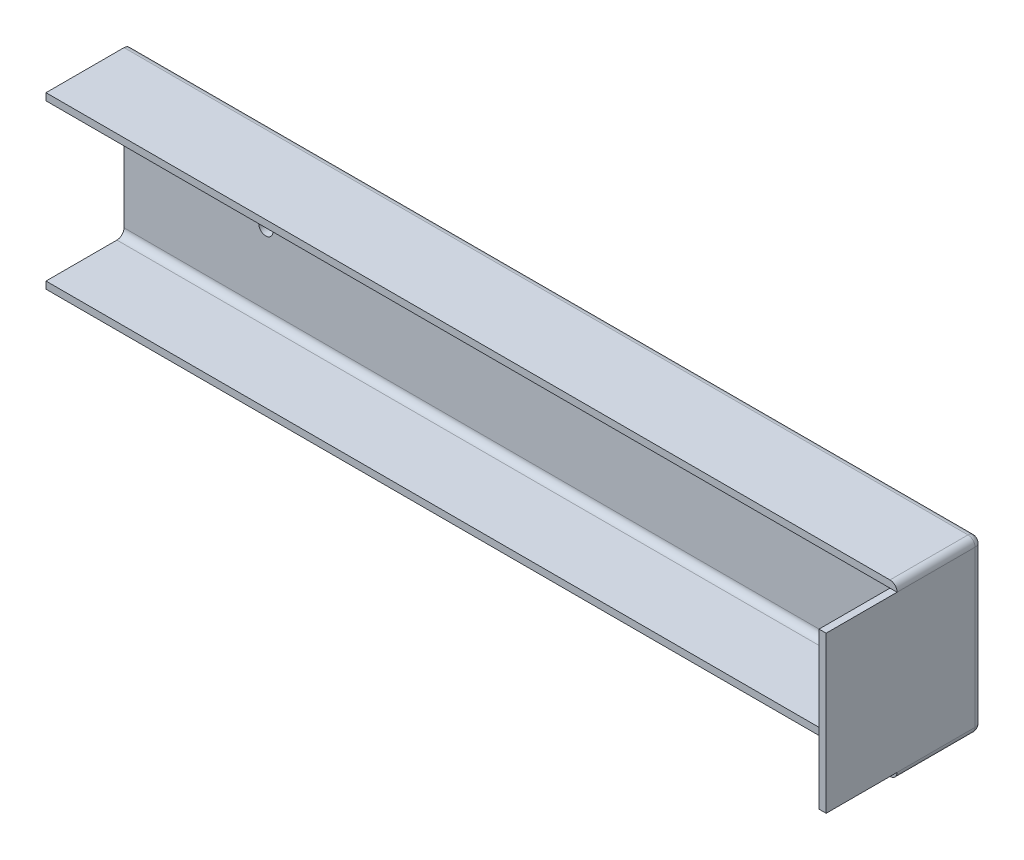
ISO-10303-21;
HEADER;
FILE_DESCRIPTION(('STEP AP214'),'2;1');
FILE_NAME('part.step','',(''),(''),'','','');
FILE_SCHEMA(('AUTOMOTIVE_DESIGN { 1 0 10303 214 1 1 1 1 }'));
ENDSEC;
DATA;
#1=APPLICATION_CONTEXT('core data for automotive mechanical design processes');
#2=APPLICATION_PROTOCOL_DEFINITION('international standard','automotive_design',2000,#1);
#3=PRODUCT_CONTEXT('',#1,'mechanical');
#4=PRODUCT('Part','Part','',(#3));
#5=PRODUCT_RELATED_PRODUCT_CATEGORY('part','',(#4));
#6=PRODUCT_DEFINITION_FORMATION('','',#4);
#7=PRODUCT_DEFINITION_CONTEXT('part definition',#1,'design');
#8=PRODUCT_DEFINITION('design','',#6,#7);
#9=PRODUCT_DEFINITION_SHAPE('','',#8);
#10=(LENGTH_UNIT() NAMED_UNIT(*) SI_UNIT(.MILLI.,.METRE.));
#11=(NAMED_UNIT(*) PLANE_ANGLE_UNIT() SI_UNIT($,.RADIAN.));
#12=(NAMED_UNIT(*) SI_UNIT($,.STERADIAN.) SOLID_ANGLE_UNIT());
#13=UNCERTAINTY_MEASURE_WITH_UNIT(LENGTH_MEASURE(1.E-05),#10,'distance_accuracy_value','');
#14=(GEOMETRIC_REPRESENTATION_CONTEXT(3) GLOBAL_UNCERTAINTY_ASSIGNED_CONTEXT((#13)) GLOBAL_UNIT_ASSIGNED_CONTEXT((#10,
#11,#12)) REPRESENTATION_CONTEXT('',''));
#15=CARTESIAN_POINT('',(0.,0.,0.));
#16=DIRECTION('',(0.,0.,1.));
#17=DIRECTION('',(1.,0.,0.));
#18=AXIS2_PLACEMENT_3D('',#15,#16,#17);
#19=CARTESIAN_POINT('',(-120.,-22.,2.));
#20=DIRECTION('',(0.,-1.,0.));
#21=DIRECTION('',(0.,0.,-1.));
#22=AXIS2_PLACEMENT_3D('',#19,#20,#21);
#23=PLANE('',#22);
#24=DIRECTION('',(0.,0.,-1.));
#25=VECTOR('',#24,1.);
#26=CARTESIAN_POINT('',(118.,-22.,44.));
#27=LINE('',#26,#25);
#28=CARTESIAN_POINT('',(118.,-22.,24.));
#29=VERTEX_POINT('',#28);
#30=CARTESIAN_POINT('',(118.,-22.,4.));
#31=VERTEX_POINT('',#30);
#32=EDGE_CURVE('E172',#29,#31,#27,.T.);
#33=ORIENTED_EDGE('',*,*,#32,.T.);
#34=DIRECTION('',(1.,0.,0.));
#35=VECTOR('',#34,1.);
#36=CARTESIAN_POINT('',(-120.,-22.,4.));
#37=LINE('',#36,#35);
#38=CARTESIAN_POINT('',(-120.,-22.,4.));
#39=VERTEX_POINT('',#38);
#40=EDGE_CURVE('E250',#31,#39,#37,.F.);
#41=ORIENTED_EDGE('',*,*,#40,.T.);
#42=DIRECTION('',(0.,0.,1.));
#43=VECTOR('',#42,1.);
#44=CARTESIAN_POINT('',(-120.,-22.,2.));
#45=LINE('',#44,#43);
#46=CARTESIAN_POINT('',(-120.,-22.,24.));
#47=VERTEX_POINT('',#46);
#48=EDGE_CURVE('E207',#39,#47,#45,.T.);
#49=ORIENTED_EDGE('',*,*,#48,.T.);
#50=DIRECTION('',(1.,0.,0.));
#51=VECTOR('',#50,1.);
#52=CARTESIAN_POINT('',(-120.,-22.,24.));
#53=LINE('',#52,#51);
#54=EDGE_CURVE('E202',#47,#29,#53,.T.);
#55=ORIENTED_EDGE('',*,*,#54,.T.);
#56=EDGE_LOOP('',(#33,#41,#49,#55));
#57=FACE_BOUND('',#56,.T.);
#58=ADVANCED_FACE('F35',(#57),#23,.F.);
#59=CARTESIAN_POINT('',(-120.,22.,2.));
#60=DIRECTION('',(0.,1.,0.));
#61=DIRECTION('',(0.,0.,1.));
#62=AXIS2_PLACEMENT_3D('',#59,#60,#61);
#63=PLANE('',#62);
#64=DIRECTION('',(0.,0.,1.));
#65=VECTOR('',#64,1.);
#66=CARTESIAN_POINT('',(118.,22.,44.));
#67=LINE('',#66,#65);
#68=CARTESIAN_POINT('',(118.,22.,4.));
#69=VERTEX_POINT('',#68);
#70=CARTESIAN_POINT('',(118.,22.,24.));
#71=VERTEX_POINT('',#70);
#72=EDGE_CURVE('E164',#69,#71,#67,.T.);
#73=ORIENTED_EDGE('',*,*,#72,.T.);
#74=DIRECTION('',(-1.,0.,0.));
#75=VECTOR('',#74,1.);
#76=CARTESIAN_POINT('',(-120.,22.,24.));
#77=LINE('',#76,#75);
#78=CARTESIAN_POINT('',(-120.,22.,24.));
#79=VERTEX_POINT('',#78);
#80=EDGE_CURVE('E197',#71,#79,#77,.T.);
#81=ORIENTED_EDGE('',*,*,#80,.T.);
#82=DIRECTION('',(0.,0.,1.));
#83=VECTOR('',#82,1.);
#84=CARTESIAN_POINT('',(-120.,22.,2.));
#85=LINE('',#84,#83);
#86=CARTESIAN_POINT('',(-120.,22.,4.));
#87=VERTEX_POINT('',#86);
#88=EDGE_CURVE('E201',#87,#79,#85,.T.);
#89=ORIENTED_EDGE('',*,*,#88,.F.);
#90=DIRECTION('',(-1.,0.,0.));
#91=VECTOR('',#90,1.);
#92=CARTESIAN_POINT('',(-120.,22.,4.));
#93=LINE('',#92,#91);
#94=EDGE_CURVE('E247',#87,#69,#93,.F.);
#95=ORIENTED_EDGE('',*,*,#94,.T.);
#96=EDGE_LOOP('',(#73,#81,#89,#95));
#97=FACE_BOUND('',#96,.T.);
#98=ADVANCED_FACE('F304',(#97),#63,.F.);
#99=CARTESIAN_POINT('',(0.,0.,2.));
#100=DIRECTION('',(0.,0.,1.));
#101=DIRECTION('',(1.,0.,0.));
#102=AXIS2_PLACEMENT_3D('',#99,#100,#101);
#103=PLANE('',#102);
#104=CARTESIAN_POINT('',(-80.,0.,2.));
#105=DIRECTION('',(0.,0.,1.));
#106=DIRECTION('',(1.,0.,0.));
#107=AXIS2_PLACEMENT_3D('',#104,#105,#106);
#108=CIRCLE('',#107,2.);
#109=CARTESIAN_POINT('',(-78.,0.,2.));
#110=VERTEX_POINT('',#109);
#111=EDGE_CURVE('E182',#110,#110,#108,.T.);
#112=ORIENTED_EDGE('',*,*,#111,.F.);
#113=EDGE_LOOP('',(#112));
#114=FACE_BOUND('',#113,.T.);
#115=DIRECTION('',(1.,0.,0.));
#116=VECTOR('',#115,1.);
#117=CARTESIAN_POINT('',(0.,-20.,2.));
#118=LINE('',#117,#116);
#119=CARTESIAN_POINT('',(-120.,-20.,2.));
#120=VERTEX_POINT('',#119);
#121=CARTESIAN_POINT('',(118.,-20.,2.));
#122=VERTEX_POINT('',#121);
#123=EDGE_CURVE('E242',#120,#122,#118,.T.);
#124=ORIENTED_EDGE('',*,*,#123,.T.);
#125=DIRECTION('',(0.,1.,0.));
#126=VECTOR('',#125,1.);
#127=CARTESIAN_POINT('',(118.,0.,2.));
#128=LINE('',#127,#126);
#129=CARTESIAN_POINT('',(118.,20.,2.));
#130=VERTEX_POINT('',#129);
#131=EDGE_CURVE('E189',#122,#130,#128,.T.);
#132=ORIENTED_EDGE('',*,*,#131,.T.);
#133=DIRECTION('',(-1.,0.,0.));
#134=VECTOR('',#133,1.);
#135=CARTESIAN_POINT('',(0.,20.,2.));
#136=LINE('',#135,#134);
#137=CARTESIAN_POINT('',(-120.,20.,2.));
#138=VERTEX_POINT('',#137);
#139=EDGE_CURVE('E245',#130,#138,#136,.T.);
#140=ORIENTED_EDGE('',*,*,#139,.T.);
#141=DIRECTION('',(0.,-1.,0.));
#142=VECTOR('',#141,1.);
#143=CARTESIAN_POINT('',(-120.,22.,2.));
#144=LINE('',#143,#142);
#145=EDGE_CURVE('E198',#138,#120,#144,.T.);
#146=ORIENTED_EDGE('',*,*,#145,.T.);
#147=EDGE_LOOP('',(#124,#132,#140,#146));
#148=FACE_BOUND('',#147,.T.);
#149=ADVANCED_FACE('F316',(#114,#148),#103,.T.);
#150=CARTESIAN_POINT('',(0.,20.,4.));
#151=DIRECTION('',(-1.,0.,0.));
#152=DIRECTION('',(0.,0.,1.));
#153=AXIS2_PLACEMENT_3D('',#150,#151,#152);
#154=CYLINDRICAL_SURFACE('',#153,2.);
#155=CARTESIAN_POINT('',(118.,20.,4.));
#156=DIRECTION('',(1.,0.,0.));
#157=DIRECTION('',(0.,0.,-1.));
#158=AXIS2_PLACEMENT_3D('',#155,#156,#157);
#159=CIRCLE('',#158,2.);
#160=EDGE_CURVE('E193',#69,#130,#159,.F.);
#161=ORIENTED_EDGE('',*,*,#160,.F.);
#162=ORIENTED_EDGE('',*,*,#94,.F.);
#163=CARTESIAN_POINT('',(-120.,20.,4.));
#164=DIRECTION('',(1.,0.,0.));
#165=DIRECTION('',(0.,0.,-1.));
#166=AXIS2_PLACEMENT_3D('',#163,#164,#165);
#167=CIRCLE('',#166,2.);
#168=EDGE_CURVE('E252',#138,#87,#167,.T.);
#169=ORIENTED_EDGE('',*,*,#168,.F.);
#170=ORIENTED_EDGE('',*,*,#139,.F.);
#171=EDGE_LOOP('',(#161,#162,#169,#170));
#172=FACE_BOUND('',#171,.T.);
#173=ADVANCED_FACE('F313',(#172),#154,.F.);
#174=CARTESIAN_POINT('',(0.,-20.,4.));
#175=DIRECTION('',(1.,0.,0.));
#176=DIRECTION('',(0.,0.,-1.));
#177=AXIS2_PLACEMENT_3D('',#174,#175,#176);
#178=CYLINDRICAL_SURFACE('',#177,2.);
#179=CARTESIAN_POINT('',(118.,-20.,4.));
#180=DIRECTION('',(1.,0.,0.));
#181=DIRECTION('',(0.,0.,-1.));
#182=AXIS2_PLACEMENT_3D('',#179,#180,#181);
#183=CIRCLE('',#182,2.);
#184=EDGE_CURVE('E256',#122,#31,#183,.F.);
#185=ORIENTED_EDGE('',*,*,#184,.F.);
#186=ORIENTED_EDGE('',*,*,#123,.F.);
#187=CARTESIAN_POINT('',(-120.,-20.,4.));
#188=DIRECTION('',(1.,0.,0.));
#189=DIRECTION('',(0.,0.,-1.));
#190=AXIS2_PLACEMENT_3D('',#187,#188,#189);
#191=CIRCLE('',#190,2.);
#192=EDGE_CURVE('E254',#39,#120,#191,.T.);
#193=ORIENTED_EDGE('',*,*,#192,.F.);
#194=ORIENTED_EDGE('',*,*,#40,.F.);
#195=EDGE_LOOP('',(#185,#186,#193,#194));
#196=FACE_BOUND('',#195,.T.);
#197=ADVANCED_FACE('F320',(#196),#178,.F.);
#198=CARTESIAN_POINT('',(0.,0.,24.));
#199=DIRECTION('',(0.,0.,1.));
#200=DIRECTION('',(1.,0.,0.));
#201=AXIS2_PLACEMENT_3D('',#198,#199,#200);
#202=PLANE('',#201);
#203=DIRECTION('',(1.,0.,0.));
#204=VECTOR('',#203,1.);
#205=CARTESIAN_POINT('',(-120.,-24.,24.));
#206=LINE('',#205,#204);
#207=CARTESIAN_POINT('',(-120.,-24.,24.));
#208=VERTEX_POINT('',#207);
#209=CARTESIAN_POINT('',(118.,-24.,24.));
#210=VERTEX_POINT('',#209);
#211=EDGE_CURVE('E218',#208,#210,#206,.T.);
#212=ORIENTED_EDGE('',*,*,#211,.T.);
#213=CARTESIAN_POINT('',(118.,-22.,24.));
#214=DIRECTION('',(0.,0.,1.));
#215=DIRECTION('',(1.,0.,0.));
#216=AXIS2_PLACEMENT_3D('',#213,#214,#215);
#217=CIRCLE('',#216,2.);
#218=CARTESIAN_POINT('',(120.,-22.,24.));
#219=VERTEX_POINT('',#218);
#220=EDGE_CURVE('E267',#210,#219,#217,.T.);
#221=ORIENTED_EDGE('',*,*,#220,.T.);
#222=DIRECTION('',(1.,0.,0.));
#223=VECTOR('',#222,1.);
#224=CARTESIAN_POINT('',(0.,-22.,24.));
#225=LINE('',#224,#223);
#226=EDGE_CURVE('E195',#29,#219,#225,.T.);
#227=ORIENTED_EDGE('',*,*,#226,.F.);
#228=ORIENTED_EDGE('',*,*,#54,.F.);
#229=DIRECTION('',(0.,-1.,0.));
#230=VECTOR('',#229,1.);
#231=CARTESIAN_POINT('',(-120.,24.,24.));
#232=LINE('',#231,#230);
#233=EDGE_CURVE('E214',#47,#208,#232,.T.);
#234=ORIENTED_EDGE('',*,*,#233,.T.);
#235=EDGE_LOOP('',(#212,#221,#227,#228,#234));
#236=FACE_BOUND('',#235,.T.);
#237=ADVANCED_FACE('F327',(#236),#202,.T.);
#238=CARTESIAN_POINT('',(120.,24.,24.));
#239=DIRECTION('',(-1.,0.,0.));
#240=DIRECTION('',(0.,0.,1.));
#241=AXIS2_PLACEMENT_3D('',#238,#239,#240);
#242=PLANE('',#241);
#243=DIRECTION('',(0.,0.,-1.));
#244=VECTOR('',#243,1.);
#245=CARTESIAN_POINT('',(120.,-22.,44.));
#246=LINE('',#245,#244);
#247=CARTESIAN_POINT('',(120.,-22.,44.));
#248=VERTEX_POINT('',#247);
#249=EDGE_CURVE('E158',#248,#219,#246,.T.);
#250=ORIENTED_EDGE('',*,*,#249,.T.);
#251=DIRECTION('',(0.,0.,-1.));
#252=VECTOR('',#251,1.);
#253=CARTESIAN_POINT('',(120.,-22.,24.));
#254=LINE('',#253,#252);
#255=CARTESIAN_POINT('',(120.,-22.,2.));
#256=VERTEX_POINT('',#255);
#257=EDGE_CURVE('E262',#219,#256,#254,.T.);
#258=ORIENTED_EDGE('',*,*,#257,.T.);
#259=DIRECTION('',(0.,1.,0.));
#260=VECTOR('',#259,1.);
#261=CARTESIAN_POINT('',(120.,24.,2.));
#262=LINE('',#261,#260);
#263=CARTESIAN_POINT('',(120.,22.,2.));
#264=VERTEX_POINT('',#263);
#265=EDGE_CURVE('E258',#256,#264,#262,.T.);
#266=ORIENTED_EDGE('',*,*,#265,.T.);
#267=DIRECTION('',(0.,0.,-1.));
#268=VECTOR('',#267,1.);
#269=CARTESIAN_POINT('',(120.,22.,24.));
#270=LINE('',#269,#268);
#271=CARTESIAN_POINT('',(120.,22.,24.));
#272=VERTEX_POINT('',#271);
#273=EDGE_CURVE('E260',#264,#272,#270,.F.);
#274=ORIENTED_EDGE('',*,*,#273,.T.);
#275=DIRECTION('',(0.,0.,1.));
#276=VECTOR('',#275,1.);
#277=CARTESIAN_POINT('',(120.,22.,44.));
#278=LINE('',#277,#276);
#279=CARTESIAN_POINT('',(120.,22.,44.));
#280=VERTEX_POINT('',#279);
#281=EDGE_CURVE('E178',#272,#280,#278,.T.);
#282=ORIENTED_EDGE('',*,*,#281,.T.);
#283=DIRECTION('',(0.,-1.,0.));
#284=VECTOR('',#283,1.);
#285=CARTESIAN_POINT('',(120.,22.,44.));
#286=LINE('',#285,#284);
#287=EDGE_CURVE('E186',#280,#248,#286,.T.);
#288=ORIENTED_EDGE('',*,*,#287,.T.);
#289=EDGE_LOOP('',(#250,#258,#266,#274,#282,#288));
#290=FACE_BOUND('',#289,.T.);
#291=ADVANCED_FACE('F295',(#290),#242,.F.);
#292=CARTESIAN_POINT('',(-120.,24.,24.));
#293=DIRECTION('',(0.,-1.,0.));
#294=DIRECTION('',(0.,0.,-1.));
#295=AXIS2_PLACEMENT_3D('',#292,#293,#294);
#296=PLANE('',#295);
#297=DIRECTION('',(-1.,0.,0.));
#298=VECTOR('',#297,1.);
#299=CARTESIAN_POINT('',(-120.,24.,24.));
#300=LINE('',#299,#298);
#301=CARTESIAN_POINT('',(118.,24.,24.));
#302=VERTEX_POINT('',#301);
#303=CARTESIAN_POINT('',(-120.,24.,24.));
#304=VERTEX_POINT('',#303);
#305=EDGE_CURVE('E212',#302,#304,#300,.T.);
#306=ORIENTED_EDGE('',*,*,#305,.F.);
#307=DIRECTION('',(0.,0.,-1.));
#308=VECTOR('',#307,1.);
#309=CARTESIAN_POINT('',(118.,24.,24.));
#310=LINE('',#309,#308);
#311=CARTESIAN_POINT('',(118.,24.,2.));
#312=VERTEX_POINT('',#311);
#313=EDGE_CURVE('E271',#302,#312,#310,.T.);
#314=ORIENTED_EDGE('',*,*,#313,.T.);
#315=DIRECTION('',(-1.,0.,0.));
#316=VECTOR('',#315,1.);
#317=CARTESIAN_POINT('',(-120.,24.,2.));
#318=LINE('',#317,#316);
#319=CARTESIAN_POINT('',(-120.,24.,2.));
#320=VERTEX_POINT('',#319);
#321=EDGE_CURVE('E229',#312,#320,#318,.T.);
#322=ORIENTED_EDGE('',*,*,#321,.T.);
#323=DIRECTION('',(0.,0.,-1.));
#324=VECTOR('',#323,1.);
#325=CARTESIAN_POINT('',(-120.,24.,24.));
#326=LINE('',#325,#324);
#327=EDGE_CURVE('E226',#304,#320,#326,.T.);
#328=ORIENTED_EDGE('',*,*,#327,.F.);
#329=EDGE_LOOP('',(#306,#314,#322,#328));
#330=FACE_BOUND('',#329,.T.);
#331=ADVANCED_FACE('F372',(#330),#296,.F.);
#332=CARTESIAN_POINT('',(-120.,24.,24.));
#333=DIRECTION('',(1.,0.,0.));
#334=DIRECTION('',(0.,0.,-1.));
#335=AXIS2_PLACEMENT_3D('',#332,#333,#334);
#336=PLANE('',#335);
#337=DIRECTION('',(0.,-1.,0.));
#338=VECTOR('',#337,1.);
#339=CARTESIAN_POINT('',(-120.,24.,0.));
#340=LINE('',#339,#338);
#341=CARTESIAN_POINT('',(-120.,22.,0.));
#342=VERTEX_POINT('',#341);
#343=CARTESIAN_POINT('',(-120.,-22.,0.));
#344=VERTEX_POINT('',#343);
#345=EDGE_CURVE('E209',#342,#344,#340,.T.);
#346=ORIENTED_EDGE('',*,*,#345,.T.);
#347=CARTESIAN_POINT('',(-120.,-22.,2.));
#348=DIRECTION('',(1.,0.,0.));
#349=DIRECTION('',(0.,0.,-1.));
#350=AXIS2_PLACEMENT_3D('',#347,#348,#349);
#351=CIRCLE('',#350,2.);
#352=CARTESIAN_POINT('',(-120.,-24.,2.));
#353=VERTEX_POINT('',#352);
#354=EDGE_CURVE('E240',#344,#353,#351,.F.);
#355=ORIENTED_EDGE('',*,*,#354,.T.);
#356=DIRECTION('',(0.,0.,-1.));
#357=VECTOR('',#356,1.);
#358=CARTESIAN_POINT('',(-120.,-24.,24.));
#359=LINE('',#358,#357);
#360=EDGE_CURVE('E221',#208,#353,#359,.T.);
#361=ORIENTED_EDGE('',*,*,#360,.F.);
#362=ORIENTED_EDGE('',*,*,#233,.F.);
#363=ORIENTED_EDGE('',*,*,#48,.F.);
#364=ORIENTED_EDGE('',*,*,#192,.T.);
#365=ORIENTED_EDGE('',*,*,#145,.F.);
#366=ORIENTED_EDGE('',*,*,#168,.T.);
#367=ORIENTED_EDGE('',*,*,#88,.T.);
#368=EDGE_CURVE('E215',#304,#79,#232,.T.);
#369=ORIENTED_EDGE('',*,*,#368,.F.);
#370=ORIENTED_EDGE('',*,*,#327,.T.);
#371=CARTESIAN_POINT('',(-120.,22.,2.));
#372=DIRECTION('',(1.,0.,0.));
#373=DIRECTION('',(0.,0.,-1.));
#374=AXIS2_PLACEMENT_3D('',#371,#372,#373);
#375=CIRCLE('',#374,2.);
#376=EDGE_CURVE('E231',#320,#342,#375,.F.);
#377=ORIENTED_EDGE('',*,*,#376,.T.);
#378=EDGE_LOOP('',(#346,#355,#361,#362,#363,#364,#365,#366,#367,#369,#370,#377));
#379=FACE_BOUND('',#378,.T.);
#380=ADVANCED_FACE('F307',(#379),#336,.F.);
#381=CARTESIAN_POINT('',(-120.,-24.,24.));
#382=DIRECTION('',(0.,1.,0.));
#383=DIRECTION('',(0.,0.,1.));
#384=AXIS2_PLACEMENT_3D('',#381,#382,#383);
#385=PLANE('',#384);
#386=DIRECTION('',(1.,0.,0.));
#387=VECTOR('',#386,1.);
#388=CARTESIAN_POINT('',(-120.,-24.,2.));
#389=LINE('',#388,#387);
#390=CARTESIAN_POINT('',(118.,-24.,2.));
#391=VERTEX_POINT('',#390);
#392=EDGE_CURVE('E235',#353,#391,#389,.T.);
#393=ORIENTED_EDGE('',*,*,#392,.T.);
#394=DIRECTION('',(0.,0.,-1.));
#395=VECTOR('',#394,1.);
#396=CARTESIAN_POINT('',(118.,-24.,24.));
#397=LINE('',#396,#395);
#398=EDGE_CURVE('E265',#391,#210,#397,.F.);
#399=ORIENTED_EDGE('',*,*,#398,.T.);
#400=ORIENTED_EDGE('',*,*,#211,.F.);
#401=ORIENTED_EDGE('',*,*,#360,.T.);
#402=EDGE_LOOP('',(#393,#399,#400,#401));
#403=FACE_BOUND('',#402,.T.);
#404=ADVANCED_FACE('F333',(#403),#385,.F.);
#405=EDGE_CURVE('E203',#272,#71,#77,.T.);
#406=ORIENTED_EDGE('',*,*,#405,.F.);
#407=CARTESIAN_POINT('',(118.,22.,24.));
#408=DIRECTION('',(0.,0.,1.));
#409=DIRECTION('',(1.,0.,0.));
#410=AXIS2_PLACEMENT_3D('',#407,#408,#409);
#411=CIRCLE('',#410,2.);
#412=EDGE_CURVE('E59',#272,#302,#411,.T.);
#413=ORIENTED_EDGE('',*,*,#412,.T.);
#414=ORIENTED_EDGE('',*,*,#305,.T.);
#415=ORIENTED_EDGE('',*,*,#368,.T.);
#416=ORIENTED_EDGE('',*,*,#80,.F.);
#417=EDGE_LOOP('',(#406,#413,#414,#415,#416));
#418=FACE_BOUND('',#417,.T.);
#419=ADVANCED_FACE('F299',(#418),#202,.T.);
#420=CARTESIAN_POINT('',(0.,0.,0.));
#421=DIRECTION('',(0.,0.,1.));
#422=DIRECTION('',(1.,0.,0.));
#423=AXIS2_PLACEMENT_3D('',#420,#421,#422);
#424=PLANE('',#423);
#425=CARTESIAN_POINT('',(-80.,0.,0.));
#426=DIRECTION('',(0.,0.,1.));
#427=DIRECTION('',(1.,0.,0.));
#428=AXIS2_PLACEMENT_3D('',#425,#426,#427);
#429=CIRCLE('',#428,2.);
#430=CARTESIAN_POINT('',(-78.,0.,0.));
#431=VERTEX_POINT('',#430);
#432=EDGE_CURVE('E278',#431,#431,#429,.T.);
#433=ORIENTED_EDGE('',*,*,#432,.T.);
#434=EDGE_LOOP('',(#433));
#435=FACE_BOUND('',#434,.T.);
#436=DIRECTION('',(-1.,0.,0.));
#437=VECTOR('',#436,1.);
#438=CARTESIAN_POINT('',(0.,22.,0.));
#439=LINE('',#438,#437);
#440=CARTESIAN_POINT('',(118.,22.,0.));
#441=VERTEX_POINT('',#440);
#442=EDGE_CURVE('E233',#342,#441,#439,.F.);
#443=ORIENTED_EDGE('',*,*,#442,.T.);
#444=DIRECTION('',(0.,1.,0.));
#445=VECTOR('',#444,1.);
#446=CARTESIAN_POINT('',(118.,0.,0.));
#447=LINE('',#446,#445);
#448=CARTESIAN_POINT('',(118.,-22.,0.));
#449=VERTEX_POINT('',#448);
#450=EDGE_CURVE('E11',#441,#449,#447,.F.);
#451=ORIENTED_EDGE('',*,*,#450,.T.);
#452=DIRECTION('',(1.,0.,0.));
#453=VECTOR('',#452,1.);
#454=CARTESIAN_POINT('',(0.,-22.,0.));
#455=LINE('',#454,#453);
#456=EDGE_CURVE('E238',#449,#344,#455,.F.);
#457=ORIENTED_EDGE('',*,*,#456,.T.);
#458=ORIENTED_EDGE('',*,*,#345,.F.);
#459=EDGE_LOOP('',(#443,#451,#457,#458));
#460=FACE_BOUND('',#459,.T.);
#461=ADVANCED_FACE('F363',(#435,#460),#424,.F.);
#462=CARTESIAN_POINT('',(-120.,22.,2.));
#463=DIRECTION('',(-1.,0.,0.));
#464=DIRECTION('',(0.,0.,1.));
#465=AXIS2_PLACEMENT_3D('',#462,#463,#464);
#466=CYLINDRICAL_SURFACE('',#465,2.);
#467=ORIENTED_EDGE('',*,*,#321,.F.);
#468=CARTESIAN_POINT('',(118.,22.,2.));
#469=DIRECTION('',(-1.,0.,0.));
#470=DIRECTION('',(0.,0.,1.));
#471=AXIS2_PLACEMENT_3D('',#468,#469,#470);
#472=CIRCLE('',#471,2.);
#473=EDGE_CURVE('E44',#312,#441,#472,.T.);
#474=ORIENTED_EDGE('',*,*,#473,.T.);
#475=ORIENTED_EDGE('',*,*,#442,.F.);
#476=ORIENTED_EDGE('',*,*,#376,.F.);
#477=EDGE_LOOP('',(#467,#474,#475,#476));
#478=FACE_BOUND('',#477,.T.);
#479=ADVANCED_FACE('F366',(#478),#466,.T.);
#480=CARTESIAN_POINT('',(-120.,-22.,2.));
#481=DIRECTION('',(1.,0.,0.));
#482=DIRECTION('',(0.,0.,-1.));
#483=AXIS2_PLACEMENT_3D('',#480,#481,#482);
#484=CYLINDRICAL_SURFACE('',#483,2.);
#485=ORIENTED_EDGE('',*,*,#456,.F.);
#486=CARTESIAN_POINT('',(118.,-22.,2.));
#487=DIRECTION('',(1.,0.,0.));
#488=DIRECTION('',(0.,0.,-1.));
#489=AXIS2_PLACEMENT_3D('',#486,#487,#488);
#490=CIRCLE('',#489,2.);
#491=EDGE_CURVE('E269',#449,#391,#490,.F.);
#492=ORIENTED_EDGE('',*,*,#491,.T.);
#493=ORIENTED_EDGE('',*,*,#392,.F.);
#494=ORIENTED_EDGE('',*,*,#354,.F.);
#495=EDGE_LOOP('',(#485,#492,#493,#494));
#496=FACE_BOUND('',#495,.T.);
#497=ADVANCED_FACE('F380',(#496),#484,.T.);
#498=CARTESIAN_POINT('',(118.,22.,44.));
#499=DIRECTION('',(0.,1.,0.));
#500=DIRECTION('',(0.,0.,1.));
#501=AXIS2_PLACEMENT_3D('',#498,#499,#500);
#502=PLANE('',#501);
#503=ORIENTED_EDGE('',*,*,#281,.F.);
#504=ORIENTED_EDGE('',*,*,#405,.T.);
#505=CARTESIAN_POINT('',(118.,22.,44.));
#506=VERTEX_POINT('',#505);
#507=EDGE_CURVE('E173',#71,#506,#67,.T.);
#508=ORIENTED_EDGE('',*,*,#507,.T.);
#509=DIRECTION('',(1.,0.,0.));
#510=VECTOR('',#509,1.);
#511=CARTESIAN_POINT('',(118.,22.,44.));
#512=LINE('',#511,#510);
#513=EDGE_CURVE('E163',#506,#280,#512,.T.);
#514=ORIENTED_EDGE('',*,*,#513,.T.);
#515=EDGE_LOOP('',(#503,#504,#508,#514));
#516=FACE_BOUND('',#515,.T.);
#517=ADVANCED_FACE('F297',(#516),#502,.T.);
#518=CARTESIAN_POINT('',(118.,-22.,44.));
#519=DIRECTION('',(0.,-1.,0.));
#520=DIRECTION('',(0.,0.,-1.));
#521=AXIS2_PLACEMENT_3D('',#518,#519,#520);
#522=PLANE('',#521);
#523=CARTESIAN_POINT('',(118.,-22.,44.));
#524=VERTEX_POINT('',#523);
#525=EDGE_CURVE('E155',#524,#29,#27,.T.);
#526=ORIENTED_EDGE('',*,*,#525,.T.);
#527=ORIENTED_EDGE('',*,*,#226,.T.);
#528=ORIENTED_EDGE('',*,*,#249,.F.);
#529=DIRECTION('',(1.,0.,0.));
#530=VECTOR('',#529,1.);
#531=CARTESIAN_POINT('',(118.,-22.,44.));
#532=LINE('',#531,#530);
#533=EDGE_CURVE('E151',#524,#248,#532,.T.);
#534=ORIENTED_EDGE('',*,*,#533,.F.);
#535=EDGE_LOOP('',(#526,#527,#528,#534));
#536=FACE_BOUND('',#535,.T.);
#537=ADVANCED_FACE('F153',(#536),#522,.T.);
#538=CARTESIAN_POINT('',(118.,0.,0.));
#539=DIRECTION('',(1.,0.,0.));
#540=DIRECTION('',(0.,0.,-1.));
#541=AXIS2_PLACEMENT_3D('',#538,#539,#540);
#542=PLANE('',#541);
#543=ORIENTED_EDGE('',*,*,#72,.F.);
#544=ORIENTED_EDGE('',*,*,#160,.T.);
#545=ORIENTED_EDGE('',*,*,#131,.F.);
#546=ORIENTED_EDGE('',*,*,#184,.T.);
#547=ORIENTED_EDGE('',*,*,#32,.F.);
#548=ORIENTED_EDGE('',*,*,#525,.F.);
#549=DIRECTION('',(0.,-1.,0.));
#550=VECTOR('',#549,1.);
#551=CARTESIAN_POINT('',(118.,22.,44.));
#552=LINE('',#551,#550);
#553=EDGE_CURVE('E170',#506,#524,#552,.T.);
#554=ORIENTED_EDGE('',*,*,#553,.F.);
#555=ORIENTED_EDGE('',*,*,#507,.F.);
#556=EDGE_LOOP('',(#543,#544,#545,#546,#547,#548,#554,#555));
#557=FACE_BOUND('',#556,.T.);
#558=ADVANCED_FACE('F168',(#557),#542,.F.);
#559=CARTESIAN_POINT('',(118.,22.,44.));
#560=DIRECTION('',(0.,0.,1.));
#561=DIRECTION('',(0.,-1.,0.));
#562=AXIS2_PLACEMENT_3D('',#559,#560,#561);
#563=PLANE('',#562);
#564=ORIENTED_EDGE('',*,*,#287,.F.);
#565=ORIENTED_EDGE('',*,*,#513,.F.);
#566=ORIENTED_EDGE('',*,*,#553,.T.);
#567=ORIENTED_EDGE('',*,*,#533,.T.);
#568=EDGE_LOOP('',(#564,#565,#566,#567));
#569=FACE_BOUND('',#568,.T.);
#570=ADVANCED_FACE('F176',(#569),#563,.T.);
#571=CARTESIAN_POINT('',(118.,22.,24.));
#572=DIRECTION('',(0.,0.,-1.));
#573=DIRECTION('',(-1.,0.,0.));
#574=AXIS2_PLACEMENT_3D('',#571,#572,#573);
#575=CYLINDRICAL_SURFACE('',#574,2.);
#576=CARTESIAN_POINT('',(118.,22.,2.));
#577=DIRECTION('',(0.,0.,-1.));
#578=DIRECTION('',(-1.,0.,0.));
#579=AXIS2_PLACEMENT_3D('',#576,#577,#578);
#580=CIRCLE('',#579,2.);
#581=EDGE_CURVE('E39',#312,#264,#580,.T.);
#582=ORIENTED_EDGE('',*,*,#581,.F.);
#583=ORIENTED_EDGE('',*,*,#313,.F.);
#584=ORIENTED_EDGE('',*,*,#412,.F.);
#585=ORIENTED_EDGE('',*,*,#273,.F.);
#586=EDGE_LOOP('',(#582,#583,#584,#585));
#587=FACE_BOUND('',#586,.T.);
#588=ADVANCED_FACE('F37',(#587),#575,.T.);
#589=CARTESIAN_POINT('',(118.,22.,2.));
#590=DIRECTION('',(-1.,0.,0.));
#591=DIRECTION('',(0.,0.,1.));
#592=AXIS2_PLACEMENT_3D('',#589,#590,#591);
#593=SPHERICAL_SURFACE('',#592,2.);
#594=ORIENTED_EDGE('',*,*,#473,.F.);
#595=ORIENTED_EDGE('',*,*,#581,.T.);
#596=CARTESIAN_POINT('',(118.,22.,2.));
#597=DIRECTION('',(0.,-1.,0.));
#598=DIRECTION('',(0.,0.,-1.));
#599=AXIS2_PLACEMENT_3D('',#596,#597,#598);
#600=CIRCLE('',#599,2.);
#601=EDGE_CURVE('E280',#441,#264,#600,.T.);
#602=ORIENTED_EDGE('',*,*,#601,.F.);
#603=EDGE_LOOP('',(#594,#595,#602));
#604=FACE_BOUND('',#603,.T.);
#605=ADVANCED_FACE('F289',(#604),#593,.T.);
#606=CARTESIAN_POINT('',(118.,24.,2.));
#607=DIRECTION('',(0.,1.,0.));
#608=DIRECTION('',(0.,0.,1.));
#609=AXIS2_PLACEMENT_3D('',#606,#607,#608);
#610=CYLINDRICAL_SURFACE('',#609,2.);
#611=CARTESIAN_POINT('',(118.,-22.,2.));
#612=DIRECTION('',(0.,-1.,0.));
#613=DIRECTION('',(0.,0.,-1.));
#614=AXIS2_PLACEMENT_3D('',#611,#612,#613);
#615=CIRCLE('',#614,2.);
#616=EDGE_CURVE('E277',#449,#256,#615,.T.);
#617=ORIENTED_EDGE('',*,*,#616,.F.);
#618=ORIENTED_EDGE('',*,*,#450,.F.);
#619=ORIENTED_EDGE('',*,*,#601,.T.);
#620=ORIENTED_EDGE('',*,*,#265,.F.);
#621=EDGE_LOOP('',(#617,#618,#619,#620));
#622=FACE_BOUND('',#621,.T.);
#623=ADVANCED_FACE('F344',(#622),#610,.T.);
#624=CARTESIAN_POINT('',(118.,-22.,2.));
#625=DIRECTION('',(-1.,0.,0.));
#626=DIRECTION('',(0.,0.,1.));
#627=AXIS2_PLACEMENT_3D('',#624,#625,#626);
#628=SPHERICAL_SURFACE('',#627,2.);
#629=ORIENTED_EDGE('',*,*,#491,.F.);
#630=ORIENTED_EDGE('',*,*,#616,.T.);
#631=CARTESIAN_POINT('',(118.,-22.,2.));
#632=DIRECTION('',(0.,0.,1.));
#633=DIRECTION('',(1.,0.,0.));
#634=AXIS2_PLACEMENT_3D('',#631,#632,#633);
#635=CIRCLE('',#634,2.);
#636=EDGE_CURVE('E275',#391,#256,#635,.T.);
#637=ORIENTED_EDGE('',*,*,#636,.F.);
#638=EDGE_LOOP('',(#629,#630,#637));
#639=FACE_BOUND('',#638,.T.);
#640=ADVANCED_FACE('F343',(#639),#628,.T.);
#641=CARTESIAN_POINT('',(118.,-22.,24.));
#642=DIRECTION('',(0.,0.,-1.));
#643=DIRECTION('',(-1.,0.,0.));
#644=AXIS2_PLACEMENT_3D('',#641,#642,#643);
#645=CYLINDRICAL_SURFACE('',#644,2.);
#646=ORIENTED_EDGE('',*,*,#220,.F.);
#647=ORIENTED_EDGE('',*,*,#398,.F.);
#648=ORIENTED_EDGE('',*,*,#636,.T.);
#649=ORIENTED_EDGE('',*,*,#257,.F.);
#650=EDGE_LOOP('',(#646,#647,#648,#649));
#651=FACE_BOUND('',#650,.T.);
#652=ADVANCED_FACE('F338',(#651),#645,.T.);
#653=CARTESIAN_POINT('',(-80.,0.,0.));
#654=DIRECTION('',(0.,0.,1.));
#655=DIRECTION('',(1.,0.,0.));
#656=AXIS2_PLACEMENT_3D('',#653,#654,#655);
#657=CYLINDRICAL_SURFACE('',#656,2.);
#658=ORIENTED_EDGE('',*,*,#432,.F.);
#659=EDGE_LOOP('',(#658));
#660=FACE_BOUND('',#659,.T.);
#661=ORIENTED_EDGE('',*,*,#111,.T.);
#662=EDGE_LOOP('',(#661));
#663=FACE_BOUND('',#662,.T.);
#664=ADVANCED_FACE('F389',(#660,#663),#657,.F.);
#665=CLOSED_SHELL('',(#58,#98,#149,#173,#197,#237,#291,#331,#380,#404,#419,#461,#479,#497,#517,
#537,#558,#570,#588,#605,#623,#640,#652,#664));
#666=MANIFOLD_SOLID_BREP('B2',#665);
#667=ADVANCED_BREP_SHAPE_REPRESENTATION('',(#18,#666),#14);
#668=SHAPE_DEFINITION_REPRESENTATION(#9,#667);
ENDSEC;
END-ISO-10303-21;
